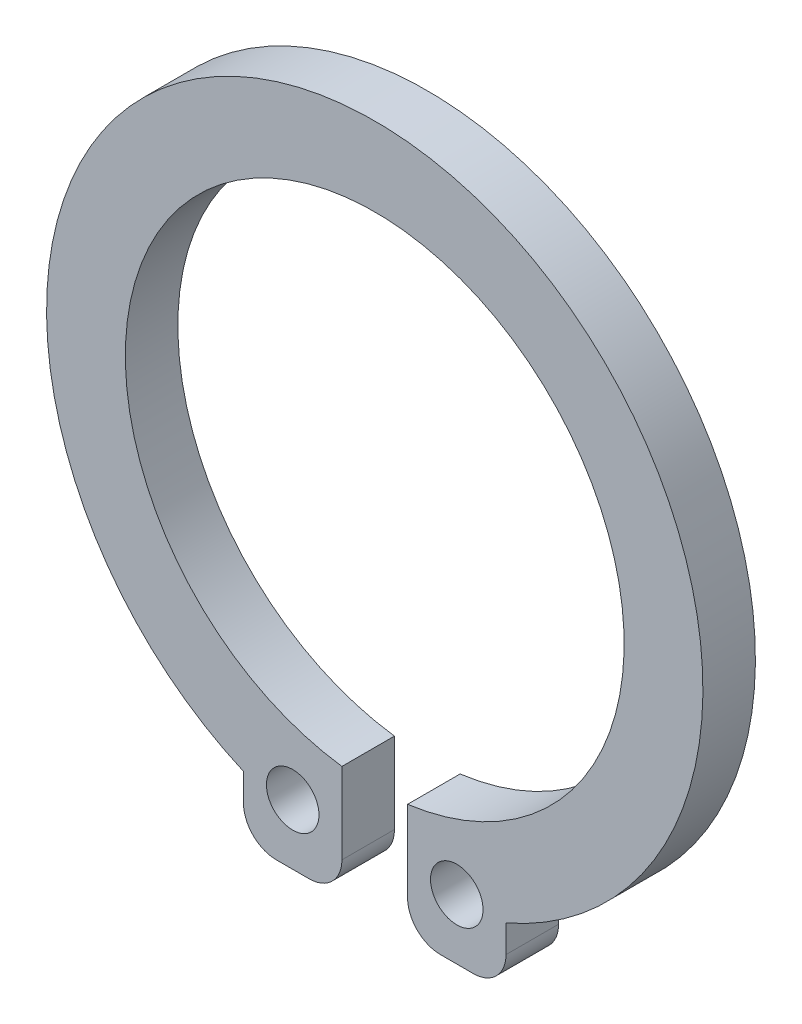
ISO-10303-21;
HEADER;
FILE_DESCRIPTION(('STEP AP214'),'2;1');
FILE_NAME('part.step','',(''),(''),'','','');
FILE_SCHEMA(('AUTOMOTIVE_DESIGN { 1 0 10303 214 1 1 1 1 }'));
ENDSEC;
DATA;
#1=APPLICATION_CONTEXT('core data for automotive mechanical design processes');
#2=APPLICATION_PROTOCOL_DEFINITION('international standard','automotive_design',2000,#1);
#3=PRODUCT_CONTEXT('',#1,'mechanical');
#4=PRODUCT('Part','Part','',(#3));
#5=PRODUCT_RELATED_PRODUCT_CATEGORY('part','',(#4));
#6=PRODUCT_DEFINITION_FORMATION('','',#4);
#7=PRODUCT_DEFINITION_CONTEXT('part definition',#1,'design');
#8=PRODUCT_DEFINITION('design','',#6,#7);
#9=PRODUCT_DEFINITION_SHAPE('','',#8);
#10=(LENGTH_UNIT() NAMED_UNIT(*) SI_UNIT(.MILLI.,.METRE.));
#11=(NAMED_UNIT(*) PLANE_ANGLE_UNIT() SI_UNIT($,.RADIAN.));
#12=(NAMED_UNIT(*) SI_UNIT($,.STERADIAN.) SOLID_ANGLE_UNIT());
#13=UNCERTAINTY_MEASURE_WITH_UNIT(LENGTH_MEASURE(1.E-05),#10,'distance_accuracy_value','');
#14=(GEOMETRIC_REPRESENTATION_CONTEXT(3) GLOBAL_UNCERTAINTY_ASSIGNED_CONTEXT((#13)) GLOBAL_UNIT_ASSIGNED_CONTEXT((#10,
#11,#12)) REPRESENTATION_CONTEXT('',''));
#15=CARTESIAN_POINT('',(0.,0.,0.));
#16=DIRECTION('',(0.,0.,1.));
#17=DIRECTION('',(1.,0.,0.));
#18=AXIS2_PLACEMENT_3D('',#15,#16,#17);
#19=CARTESIAN_POINT('',(0.,0.,0.799999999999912));
#20=DIRECTION('',(0.,0.,1.));
#21=DIRECTION('',(1.,0.,0.));
#22=AXIS2_PLACEMENT_3D('',#19,#20,#21);
#23=PLANE('',#22);
#24=CARTESIAN_POINT('',(-1.25000000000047,-4.58257569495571,0.800000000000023));
#25=DIRECTION('',(0.,0.,1.));
#26=DIRECTION('',(1.,0.,0.));
#27=AXIS2_PLACEMENT_3D('',#24,#25,#26);
#28=CIRCLE('',#27,0.4);
#29=CARTESIAN_POINT('',(-0.850000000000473,-4.58257569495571,0.800000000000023));
#30=VERTEX_POINT('',#29);
#31=EDGE_CURVE('E146',#30,#30,#28,.T.);
#32=ORIENTED_EDGE('',*,*,#31,.F.);
#33=EDGE_LOOP('',(#32));
#34=FACE_BOUND('',#33,.T.);
#35=CARTESIAN_POINT('',(0.,0.,0.799999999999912));
#36=DIRECTION('',(0.,0.,-1.));
#37=DIRECTION('',(1.,0.,0.));
#38=AXIS2_PLACEMENT_3D('',#35,#36,#37);
#39=CIRCLE('',#38,3.79999999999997);
#40=CARTESIAN_POINT('',(-0.500000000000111,-3.76696164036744,0.800000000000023));
#41=VERTEX_POINT('',#40);
#42=CARTESIAN_POINT('',(0.499999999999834,-3.76696164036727,0.799999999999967));
#43=VERTEX_POINT('',#42);
#44=EDGE_CURVE('E172',#41,#43,#39,.T.);
#45=ORIENTED_EDGE('',*,*,#44,.T.);
#46=DIRECTION('',(0.,-1.,0.));
#47=VECTOR('',#46,1.);
#48=CARTESIAN_POINT('',(0.499999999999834,-3.76696164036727,0.799999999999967));
#49=LINE('',#48,#47);
#50=CARTESIAN_POINT('',(0.5,-5.00000000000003,0.800000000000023));
#51=VERTEX_POINT('',#50);
#52=EDGE_CURVE('E141',#43,#51,#49,.T.);
#53=ORIENTED_EDGE('',*,*,#52,.T.);
#54=CARTESIAN_POINT('',(0.99999999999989,-5.,0.799999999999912));
#55=DIRECTION('',(0.,0.,1.));
#56=DIRECTION('',(-1.,0.,0.));
#57=AXIS2_PLACEMENT_3D('',#54,#55,#56);
#58=CIRCLE('',#57,0.5);
#59=CARTESIAN_POINT('',(1.,-5.50000000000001,0.800000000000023));
#60=VERTEX_POINT('',#59);
#61=EDGE_CURVE('E175',#51,#60,#58,.T.);
#62=ORIENTED_EDGE('',*,*,#61,.T.);
#63=DIRECTION('',(1.,3.69926311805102E-13,0.));
#64=VECTOR('',#63,1.);
#65=CARTESIAN_POINT('',(1.,-5.50000000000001,0.800000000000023));
#66=LINE('',#65,#64);
#67=CARTESIAN_POINT('',(1.49999999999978,-5.49999999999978,0.799999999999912));
#68=VERTEX_POINT('',#67);
#69=EDGE_CURVE('E177',#60,#68,#66,.T.);
#70=ORIENTED_EDGE('',*,*,#69,.T.);
#71=CARTESIAN_POINT('',(1.5,-4.9999999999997,0.799999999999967));
#72=DIRECTION('',(0.,0.,1.));
#73=DIRECTION('',(-1.,0.,0.));
#74=AXIS2_PLACEMENT_3D('',#71,#72,#73);
#75=CIRCLE('',#74,0.5);
#76=CARTESIAN_POINT('',(1.99999999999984,-4.99999999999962,0.799999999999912));
#77=VERTEX_POINT('',#76);
#78=EDGE_CURVE('E179',#68,#77,#75,.T.);
#79=ORIENTED_EDGE('',*,*,#78,.T.);
#80=DIRECTION('',(0.,1.,0.));
#81=VECTOR('',#80,1.);
#82=CARTESIAN_POINT('',(1.99999999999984,-4.99999999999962,0.799999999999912));
#83=LINE('',#82,#81);
#84=CARTESIAN_POINT('',(1.99999999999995,-4.58257569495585,0.800000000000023));
#85=VERTEX_POINT('',#84);
#86=EDGE_CURVE('E181',#77,#85,#83,.T.);
#87=ORIENTED_EDGE('',*,*,#86,.T.);
#88=CARTESIAN_POINT('',(0.,0.,0.799999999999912));
#89=DIRECTION('',(0.,0.,1.));
#90=DIRECTION('',(1.,0.,0.));
#91=AXIS2_PLACEMENT_3D('',#88,#89,#90);
#92=CIRCLE('',#91,5.);
#93=CARTESIAN_POINT('',(-2.,-4.58257569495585,0.799999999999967));
#94=VERTEX_POINT('',#93);
#95=EDGE_CURVE('E183',#85,#94,#92,.T.);
#96=ORIENTED_EDGE('',*,*,#95,.T.);
#97=DIRECTION('',(0.,-1.,0.));
#98=VECTOR('',#97,1.);
#99=CARTESIAN_POINT('',(-2.00000000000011,-4.99999999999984,0.799999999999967));
#100=LINE('',#99,#98);
#101=CARTESIAN_POINT('',(-2.00000000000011,-4.99999999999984,0.799999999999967));
#102=VERTEX_POINT('',#101);
#103=EDGE_CURVE('E185',#94,#102,#100,.T.);
#104=ORIENTED_EDGE('',*,*,#103,.T.);
#105=CARTESIAN_POINT('',(-1.50000000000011,-4.99999999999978,0.799999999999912));
#106=DIRECTION('',(0.,0.,1.));
#107=DIRECTION('',(1.,0.,0.));
#108=AXIS2_PLACEMENT_3D('',#105,#106,#107);
#109=CIRCLE('',#108,0.5);
#110=CARTESIAN_POINT('',(-1.50000000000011,-5.49999999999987,0.799999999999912));
#111=VERTEX_POINT('',#110);
#112=EDGE_CURVE('E187',#102,#111,#109,.T.);
#113=ORIENTED_EDGE('',*,*,#112,.T.);
#114=DIRECTION('',(1.,-3.65568686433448E-13,0.));
#115=VECTOR('',#114,1.);
#116=CARTESIAN_POINT('',(-1.00000000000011,-5.50000000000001,0.799999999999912));
#117=LINE('',#116,#115);
#118=CARTESIAN_POINT('',(-1.00000000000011,-5.50000000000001,0.799999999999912));
#119=VERTEX_POINT('',#118);
#120=EDGE_CURVE('E189',#111,#119,#117,.T.);
#121=ORIENTED_EDGE('',*,*,#120,.T.);
#122=CARTESIAN_POINT('',(-1.00000000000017,-4.99999999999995,0.799999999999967));
#123=DIRECTION('',(0.,0.,1.));
#124=DIRECTION('',(1.,0.,0.));
#125=AXIS2_PLACEMENT_3D('',#122,#123,#124);
#126=CIRCLE('',#125,0.5);
#127=CARTESIAN_POINT('',(-0.500000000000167,-4.99999999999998,0.799999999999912));
#128=VERTEX_POINT('',#127);
#129=EDGE_CURVE('E58',#119,#128,#126,.T.);
#130=ORIENTED_EDGE('',*,*,#129,.T.);
#131=DIRECTION('',(0.,1.,0.));
#132=VECTOR('',#131,1.);
#133=CARTESIAN_POINT('',(-0.500000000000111,-3.76696164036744,0.800000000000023));
#134=LINE('',#133,#132);
#135=EDGE_CURVE('E53',#128,#41,#134,.T.);
#136=ORIENTED_EDGE('',*,*,#135,.T.);
#137=EDGE_LOOP('',(#45,#53,#62,#70,#79,#87,#96,#104,#113,#121,#130,#136));
#138=FACE_BOUND('',#137,.T.);
#139=CARTESIAN_POINT('',(1.2500000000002,-4.58257569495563,0.799999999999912));
#140=DIRECTION('',(0.,0.,1.));
#141=DIRECTION('',(-1.,0.,0.));
#142=AXIS2_PLACEMENT_3D('',#139,#140,#141);
#143=CIRCLE('',#142,0.4);
#144=CARTESIAN_POINT('',(0.850000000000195,-4.58257569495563,0.799999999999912));
#145=VERTEX_POINT('',#144);
#146=EDGE_CURVE('E292',#145,#145,#143,.T.);
#147=ORIENTED_EDGE('',*,*,#146,.F.);
#148=EDGE_LOOP('',(#147));
#149=FACE_BOUND('',#148,.T.);
#150=ADVANCED_FACE('F38',(#34,#138,#149),#23,.T.);
#151=CARTESIAN_POINT('',(0.,0.,0.));
#152=DIRECTION('',(0.,0.,1.));
#153=DIRECTION('',(1.,0.,0.));
#154=AXIS2_PLACEMENT_3D('',#151,#152,#153);
#155=PLANE('',#154);
#156=CARTESIAN_POINT('',(-1.25000000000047,-4.58257569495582,0.));
#157=DIRECTION('',(0.,0.,1.));
#158=DIRECTION('',(1.,0.,0.));
#159=AXIS2_PLACEMENT_3D('',#156,#157,#158);
#160=CIRCLE('',#159,0.4);
#161=CARTESIAN_POINT('',(-0.850000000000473,-4.58257569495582,0.));
#162=VERTEX_POINT('',#161);
#163=EDGE_CURVE('E149',#162,#162,#160,.T.);
#164=ORIENTED_EDGE('',*,*,#163,.T.);
#165=EDGE_LOOP('',(#164));
#166=FACE_BOUND('',#165,.T.);
#167=CARTESIAN_POINT('',(0.,0.,0.));
#168=DIRECTION('',(0.,0.,-1.));
#169=DIRECTION('',(1.,0.,0.));
#170=AXIS2_PLACEMENT_3D('',#167,#168,#169);
#171=CIRCLE('',#170,3.79999999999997);
#172=CARTESIAN_POINT('',(-0.500000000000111,-3.76696164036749,0.));
#173=VERTEX_POINT('',#172);
#174=CARTESIAN_POINT('',(0.499999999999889,-3.76696164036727,0.));
#175=VERTEX_POINT('',#174);
#176=EDGE_CURVE('E132',#173,#175,#171,.T.);
#177=ORIENTED_EDGE('',*,*,#176,.F.);
#178=DIRECTION('',(0.,1.,0.));
#179=VECTOR('',#178,1.);
#180=CARTESIAN_POINT('',(-0.500000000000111,-3.76696164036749,0.));
#181=LINE('',#180,#179);
#182=CARTESIAN_POINT('',(-0.500000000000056,-5.,0.));
#183=VERTEX_POINT('',#182);
#184=EDGE_CURVE('E170',#183,#173,#181,.T.);
#185=ORIENTED_EDGE('',*,*,#184,.F.);
#186=CARTESIAN_POINT('',(-1.00000000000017,-4.99999999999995,0.));
#187=DIRECTION('',(0.,0.,1.));
#188=DIRECTION('',(1.,0.,0.));
#189=AXIS2_PLACEMENT_3D('',#186,#187,#188);
#190=CIRCLE('',#189,0.5);
#191=CARTESIAN_POINT('',(-1.00000000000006,-5.50000000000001,0.));
#192=VERTEX_POINT('',#191);
#193=EDGE_CURVE('E168',#192,#183,#190,.T.);
#194=ORIENTED_EDGE('',*,*,#193,.F.);
#195=DIRECTION('',(1.,-3.65568686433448E-13,0.));
#196=VECTOR('',#195,1.);
#197=CARTESIAN_POINT('',(-1.00000000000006,-5.50000000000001,0.));
#198=LINE('',#197,#196);
#199=CARTESIAN_POINT('',(-1.50000000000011,-5.49999999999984,0.));
#200=VERTEX_POINT('',#199);
#201=EDGE_CURVE('E166',#200,#192,#198,.T.);
#202=ORIENTED_EDGE('',*,*,#201,.F.);
#203=CARTESIAN_POINT('',(-1.5,-4.99999999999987,0.));
#204=DIRECTION('',(0.,0.,1.));
#205=DIRECTION('',(1.,0.,0.));
#206=AXIS2_PLACEMENT_3D('',#203,#204,#205);
#207=CIRCLE('',#206,0.5);
#208=CARTESIAN_POINT('',(-2.,-4.99999999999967,0.));
#209=VERTEX_POINT('',#208);
#210=EDGE_CURVE('E164',#209,#200,#207,.T.);
#211=ORIENTED_EDGE('',*,*,#210,.F.);
#212=DIRECTION('',(0.,-1.,0.));
#213=VECTOR('',#212,1.);
#214=CARTESIAN_POINT('',(-2.,-4.99999999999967,0.));
#215=LINE('',#214,#213);
#216=CARTESIAN_POINT('',(-2.00000000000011,-4.58257569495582,0.));
#217=VERTEX_POINT('',#216);
#218=EDGE_CURVE('E162',#217,#209,#215,.T.);
#219=ORIENTED_EDGE('',*,*,#218,.F.);
#220=CARTESIAN_POINT('',(0.,0.,0.));
#221=DIRECTION('',(0.,0.,1.));
#222=DIRECTION('',(1.,0.,0.));
#223=AXIS2_PLACEMENT_3D('',#220,#221,#222);
#224=CIRCLE('',#223,5.);
#225=CARTESIAN_POINT('',(2.,-4.58257569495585,0.));
#226=VERTEX_POINT('',#225);
#227=EDGE_CURVE('E160',#226,#217,#224,.T.);
#228=ORIENTED_EDGE('',*,*,#227,.F.);
#229=DIRECTION('',(0.,1.,0.));
#230=VECTOR('',#229,1.);
#231=CARTESIAN_POINT('',(1.99999999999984,-4.99999999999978,0.));
#232=LINE('',#231,#230);
#233=CARTESIAN_POINT('',(1.99999999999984,-4.99999999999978,0.));
#234=VERTEX_POINT('',#233);
#235=EDGE_CURVE('E158',#234,#226,#232,.T.);
#236=ORIENTED_EDGE('',*,*,#235,.F.);
#237=CARTESIAN_POINT('',(1.49999999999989,-4.99999999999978,-1.11022302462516E-13));
#238=DIRECTION('',(0.,0.,1.));
#239=DIRECTION('',(-1.,0.,0.));
#240=AXIS2_PLACEMENT_3D('',#237,#238,#239);
#241=CIRCLE('',#240,0.5);
#242=CARTESIAN_POINT('',(1.49999999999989,-5.49999999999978,0.));
#243=VERTEX_POINT('',#242);
#244=EDGE_CURVE('E156',#243,#234,#241,.T.);
#245=ORIENTED_EDGE('',*,*,#244,.F.);
#246=DIRECTION('',(1.,3.69926311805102E-13,0.));
#247=VECTOR('',#246,1.);
#248=CARTESIAN_POINT('',(1.,-5.49999999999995,0.));
#249=LINE('',#248,#247);
#250=CARTESIAN_POINT('',(1.,-5.49999999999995,0.));
#251=VERTEX_POINT('',#250);
#252=EDGE_CURVE('E154',#251,#243,#249,.T.);
#253=ORIENTED_EDGE('',*,*,#252,.F.);
#254=CARTESIAN_POINT('',(0.999999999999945,-4.99999999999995,0.));
#255=DIRECTION('',(0.,0.,1.));
#256=DIRECTION('',(-1.,0.,0.));
#257=AXIS2_PLACEMENT_3D('',#254,#255,#256);
#258=CIRCLE('',#257,0.5);
#259=CARTESIAN_POINT('',(0.499999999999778,-4.99999999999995,0.));
#260=VERTEX_POINT('',#259);
#261=EDGE_CURVE('E134',#260,#251,#258,.T.);
#262=ORIENTED_EDGE('',*,*,#261,.F.);
#263=DIRECTION('',(0.,-1.,0.));
#264=VECTOR('',#263,1.);
#265=CARTESIAN_POINT('',(0.499999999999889,-3.76696164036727,0.));
#266=LINE('',#265,#264);
#267=EDGE_CURVE('E127',#175,#260,#266,.T.);
#268=ORIENTED_EDGE('',*,*,#267,.F.);
#269=EDGE_LOOP('',(#177,#185,#194,#202,#211,#219,#228,#236,#245,#253,#262,#268));
#270=FACE_BOUND('',#269,.T.);
#271=CARTESIAN_POINT('',(1.25000000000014,-4.58257569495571,0.));
#272=DIRECTION('',(0.,0.,1.));
#273=DIRECTION('',(-1.,0.,0.));
#274=AXIS2_PLACEMENT_3D('',#271,#272,#273);
#275=CIRCLE('',#274,0.4);
#276=CARTESIAN_POINT('',(0.85000000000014,-4.58257569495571,0.));
#277=VERTEX_POINT('',#276);
#278=EDGE_CURVE('E295',#277,#277,#275,.T.);
#279=ORIENTED_EDGE('',*,*,#278,.T.);
#280=EDGE_LOOP('',(#279));
#281=FACE_BOUND('',#280,.T.);
#282=ADVANCED_FACE('F128',(#166,#270,#281),#155,.F.);
#283=CARTESIAN_POINT('',(0.,0.,0.799999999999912));
#284=DIRECTION('',(0.,0.,-1.));
#285=DIRECTION('',(-1.,0.,0.));
#286=AXIS2_PLACEMENT_3D('',#283,#284,#285);
#287=CYLINDRICAL_SURFACE('',#286,3.79999999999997);
#288=ORIENTED_EDGE('',*,*,#176,.T.);
#289=DIRECTION('',(0.,0.,-1.));
#290=VECTOR('',#289,1.);
#291=CARTESIAN_POINT('',(0.499999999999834,-3.76696164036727,0.799999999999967));
#292=LINE('',#291,#290);
#293=EDGE_CURVE('E11',#43,#175,#292,.T.);
#294=ORIENTED_EDGE('',*,*,#293,.F.);
#295=ORIENTED_EDGE('',*,*,#44,.F.);
#296=DIRECTION('',(0.,0.,-1.));
#297=VECTOR('',#296,1.);
#298=CARTESIAN_POINT('',(-0.500000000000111,-3.76696164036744,0.800000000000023));
#299=LINE('',#298,#297);
#300=EDGE_CURVE('E145',#41,#173,#299,.T.);
#301=ORIENTED_EDGE('',*,*,#300,.T.);
#302=EDGE_LOOP('',(#288,#294,#295,#301));
#303=FACE_BOUND('',#302,.T.);
#304=ADVANCED_FACE('F40',(#303),#287,.F.);
#305=CARTESIAN_POINT('',(0.499999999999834,-3.76696164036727,0.799999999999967));
#306=DIRECTION('',(1.,0.,0.));
#307=DIRECTION('',(0.,1.,0.));
#308=AXIS2_PLACEMENT_3D('',#305,#306,#307);
#309=PLANE('',#308);
#310=ORIENTED_EDGE('',*,*,#267,.T.);
#311=DIRECTION('',(0.,0.,-1.));
#312=VECTOR('',#311,1.);
#313=CARTESIAN_POINT('',(0.5,-5.00000000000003,0.800000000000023));
#314=LINE('',#313,#312);
#315=EDGE_CURVE('E46',#51,#260,#314,.T.);
#316=ORIENTED_EDGE('',*,*,#315,.F.);
#317=ORIENTED_EDGE('',*,*,#52,.F.);
#318=ORIENTED_EDGE('',*,*,#293,.T.);
#319=EDGE_LOOP('',(#310,#316,#317,#318));
#320=FACE_BOUND('',#319,.T.);
#321=ADVANCED_FACE('F140',(#320),#309,.F.);
#322=CARTESIAN_POINT('',(0.99999999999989,-5.,0.799999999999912));
#323=DIRECTION('',(0.,0.,-1.));
#324=DIRECTION('',(-1.,0.,0.));
#325=AXIS2_PLACEMENT_3D('',#322,#323,#324);
#326=CYLINDRICAL_SURFACE('',#325,0.5);
#327=ORIENTED_EDGE('',*,*,#261,.T.);
#328=DIRECTION('',(0.,0.,-1.));
#329=VECTOR('',#328,1.);
#330=CARTESIAN_POINT('',(1.,-5.50000000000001,0.800000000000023));
#331=LINE('',#330,#329);
#332=EDGE_CURVE('E218',#60,#251,#331,.T.);
#333=ORIENTED_EDGE('',*,*,#332,.F.);
#334=ORIENTED_EDGE('',*,*,#61,.F.);
#335=ORIENTED_EDGE('',*,*,#315,.T.);
#336=EDGE_LOOP('',(#327,#333,#334,#335));
#337=FACE_BOUND('',#336,.T.);
#338=ADVANCED_FACE('F222',(#337),#326,.T.);
#339=CARTESIAN_POINT('',(1.,-5.50000000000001,0.800000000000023));
#340=DIRECTION('',(-3.69038133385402E-13,1.,0.));
#341=DIRECTION('',(-1.,-3.69926311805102E-13,0.));
#342=AXIS2_PLACEMENT_3D('',#339,#340,#341);
#343=PLANE('',#342);
#344=ORIENTED_EDGE('',*,*,#252,.T.);
#345=DIRECTION('',(0.,0.,-1.));
#346=VECTOR('',#345,1.);
#347=CARTESIAN_POINT('',(1.49999999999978,-5.49999999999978,0.799999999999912));
#348=LINE('',#347,#346);
#349=EDGE_CURVE('E215',#68,#243,#348,.T.);
#350=ORIENTED_EDGE('',*,*,#349,.F.);
#351=ORIENTED_EDGE('',*,*,#69,.F.);
#352=ORIENTED_EDGE('',*,*,#332,.T.);
#353=EDGE_LOOP('',(#344,#350,#351,#352));
#354=FACE_BOUND('',#353,.T.);
#355=ADVANCED_FACE('F230',(#354),#343,.F.);
#356=CARTESIAN_POINT('',(1.5,-4.9999999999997,0.799999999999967));
#357=DIRECTION('',(0.,0.,-1.));
#358=DIRECTION('',(-1.,0.,0.));
#359=AXIS2_PLACEMENT_3D('',#356,#357,#358);
#360=CYLINDRICAL_SURFACE('',#359,0.5);
#361=ORIENTED_EDGE('',*,*,#244,.T.);
#362=DIRECTION('',(0.,0.,-1.));
#363=VECTOR('',#362,1.);
#364=CARTESIAN_POINT('',(1.99999999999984,-4.99999999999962,0.799999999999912));
#365=LINE('',#364,#363);
#366=EDGE_CURVE('E212',#77,#234,#365,.T.);
#367=ORIENTED_EDGE('',*,*,#366,.F.);
#368=ORIENTED_EDGE('',*,*,#78,.F.);
#369=ORIENTED_EDGE('',*,*,#349,.T.);
#370=EDGE_LOOP('',(#361,#367,#368,#369));
#371=FACE_BOUND('',#370,.T.);
#372=ADVANCED_FACE('F233',(#371),#360,.T.);
#373=CARTESIAN_POINT('',(1.99999999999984,-4.99999999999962,0.799999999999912));
#374=DIRECTION('',(-1.,0.,0.));
#375=DIRECTION('',(0.,-1.,0.));
#376=AXIS2_PLACEMENT_3D('',#373,#374,#375);
#377=PLANE('',#376);
#378=ORIENTED_EDGE('',*,*,#235,.T.);
#379=DIRECTION('',(0.,0.,-1.));
#380=VECTOR('',#379,1.);
#381=CARTESIAN_POINT('',(1.99999999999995,-4.58257569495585,0.800000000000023));
#382=LINE('',#381,#380);
#383=EDGE_CURVE('E209',#85,#226,#382,.T.);
#384=ORIENTED_EDGE('',*,*,#383,.F.);
#385=ORIENTED_EDGE('',*,*,#86,.F.);
#386=ORIENTED_EDGE('',*,*,#366,.T.);
#387=EDGE_LOOP('',(#378,#384,#385,#386));
#388=FACE_BOUND('',#387,.T.);
#389=ADVANCED_FACE('F238',(#388),#377,.F.);
#390=CARTESIAN_POINT('',(0.,0.,0.799999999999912));
#391=DIRECTION('',(0.,0.,-1.));
#392=DIRECTION('',(-1.,0.,0.));
#393=AXIS2_PLACEMENT_3D('',#390,#391,#392);
#394=CYLINDRICAL_SURFACE('',#393,5.);
#395=ORIENTED_EDGE('',*,*,#227,.T.);
#396=DIRECTION('',(0.,0.,-1.));
#397=VECTOR('',#396,1.);
#398=CARTESIAN_POINT('',(-2.,-4.58257569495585,0.799999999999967));
#399=LINE('',#398,#397);
#400=EDGE_CURVE('E206',#94,#217,#399,.T.);
#401=ORIENTED_EDGE('',*,*,#400,.F.);
#402=ORIENTED_EDGE('',*,*,#95,.F.);
#403=ORIENTED_EDGE('',*,*,#383,.T.);
#404=EDGE_LOOP('',(#395,#401,#402,#403));
#405=FACE_BOUND('',#404,.T.);
#406=ADVANCED_FACE('F244',(#405),#394,.T.);
#407=CARTESIAN_POINT('',(-2.00000000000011,-4.99999999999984,0.799999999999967));
#408=DIRECTION('',(1.,0.,0.));
#409=DIRECTION('',(0.,1.,0.));
#410=AXIS2_PLACEMENT_3D('',#407,#408,#409);
#411=PLANE('',#410);
#412=ORIENTED_EDGE('',*,*,#218,.T.);
#413=DIRECTION('',(0.,0.,-1.));
#414=VECTOR('',#413,1.);
#415=CARTESIAN_POINT('',(-2.00000000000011,-4.99999999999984,0.799999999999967));
#416=LINE('',#415,#414);
#417=EDGE_CURVE('E203',#102,#209,#416,.T.);
#418=ORIENTED_EDGE('',*,*,#417,.F.);
#419=ORIENTED_EDGE('',*,*,#103,.F.);
#420=ORIENTED_EDGE('',*,*,#400,.T.);
#421=EDGE_LOOP('',(#412,#418,#419,#420));
#422=FACE_BOUND('',#421,.T.);
#423=ADVANCED_FACE('F248',(#422),#411,.F.);
#424=CARTESIAN_POINT('',(-1.50000000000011,-4.99999999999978,0.799999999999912));
#425=DIRECTION('',(0.,0.,-1.));
#426=DIRECTION('',(-1.,0.,0.));
#427=AXIS2_PLACEMENT_3D('',#424,#425,#426);
#428=CYLINDRICAL_SURFACE('',#427,0.5);
#429=ORIENTED_EDGE('',*,*,#210,.T.);
#430=DIRECTION('',(0.,0.,-1.));
#431=VECTOR('',#430,1.);
#432=CARTESIAN_POINT('',(-1.50000000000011,-5.49999999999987,0.799999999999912));
#433=LINE('',#432,#431);
#434=EDGE_CURVE('E200',#111,#200,#433,.T.);
#435=ORIENTED_EDGE('',*,*,#434,.F.);
#436=ORIENTED_EDGE('',*,*,#112,.F.);
#437=ORIENTED_EDGE('',*,*,#417,.T.);
#438=EDGE_LOOP('',(#429,#435,#436,#437));
#439=FACE_BOUND('',#438,.T.);
#440=ADVANCED_FACE('F253',(#439),#428,.T.);
#441=CARTESIAN_POINT('',(-1.00000000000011,-5.50000000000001,0.799999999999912));
#442=DIRECTION('',(3.66456864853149E-13,1.,0.));
#443=DIRECTION('',(-1.,3.65568686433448E-13,0.));
#444=AXIS2_PLACEMENT_3D('',#441,#442,#443);
#445=PLANE('',#444);
#446=ORIENTED_EDGE('',*,*,#201,.T.);
#447=DIRECTION('',(0.,0.,-1.));
#448=VECTOR('',#447,1.);
#449=CARTESIAN_POINT('',(-1.00000000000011,-5.50000000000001,0.799999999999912));
#450=LINE('',#449,#448);
#451=EDGE_CURVE('E197',#119,#192,#450,.T.);
#452=ORIENTED_EDGE('',*,*,#451,.F.);
#453=ORIENTED_EDGE('',*,*,#120,.F.);
#454=ORIENTED_EDGE('',*,*,#434,.T.);
#455=EDGE_LOOP('',(#446,#452,#453,#454));
#456=FACE_BOUND('',#455,.T.);
#457=ADVANCED_FACE('F257',(#456),#445,.F.);
#458=CARTESIAN_POINT('',(-1.00000000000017,-4.99999999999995,0.799999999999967));
#459=DIRECTION('',(0.,0.,-1.));
#460=DIRECTION('',(-1.,0.,0.));
#461=AXIS2_PLACEMENT_3D('',#458,#459,#460);
#462=CYLINDRICAL_SURFACE('',#461,0.5);
#463=ORIENTED_EDGE('',*,*,#193,.T.);
#464=DIRECTION('',(0.,0.,-1.));
#465=VECTOR('',#464,1.);
#466=CARTESIAN_POINT('',(-0.500000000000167,-4.99999999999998,0.799999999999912));
#467=LINE('',#466,#465);
#468=EDGE_CURVE('E194',#128,#183,#467,.T.);
#469=ORIENTED_EDGE('',*,*,#468,.F.);
#470=ORIENTED_EDGE('',*,*,#129,.F.);
#471=ORIENTED_EDGE('',*,*,#451,.T.);
#472=EDGE_LOOP('',(#463,#469,#470,#471));
#473=FACE_BOUND('',#472,.T.);
#474=ADVANCED_FACE('F261',(#473),#462,.T.);
#475=CARTESIAN_POINT('',(-0.500000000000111,-3.76696164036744,0.800000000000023));
#476=DIRECTION('',(-1.,0.,0.));
#477=DIRECTION('',(0.,-1.,0.));
#478=AXIS2_PLACEMENT_3D('',#475,#476,#477);
#479=PLANE('',#478);
#480=ORIENTED_EDGE('',*,*,#184,.T.);
#481=ORIENTED_EDGE('',*,*,#300,.F.);
#482=ORIENTED_EDGE('',*,*,#135,.F.);
#483=ORIENTED_EDGE('',*,*,#468,.T.);
#484=EDGE_LOOP('',(#480,#481,#482,#483));
#485=FACE_BOUND('',#484,.T.);
#486=ADVANCED_FACE('F263',(#485),#479,.F.);
#487=CARTESIAN_POINT('',(-1.25000000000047,-4.58257569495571,0.800000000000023));
#488=DIRECTION('',(0.,0.,-1.));
#489=DIRECTION('',(-1.,0.,0.));
#490=AXIS2_PLACEMENT_3D('',#487,#488,#489);
#491=CYLINDRICAL_SURFACE('',#490,0.4);
#492=ORIENTED_EDGE('',*,*,#31,.T.);
#493=EDGE_LOOP('',(#492));
#494=FACE_BOUND('',#493,.T.);
#495=ORIENTED_EDGE('',*,*,#163,.F.);
#496=EDGE_LOOP('',(#495));
#497=FACE_BOUND('',#496,.T.);
#498=ADVANCED_FACE('F265',(#494,#497),#491,.F.);
#499=CARTESIAN_POINT('',(1.2500000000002,-4.58257569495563,0.799999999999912));
#500=DIRECTION('',(0.,0.,-1.));
#501=DIRECTION('',(-1.,0.,0.));
#502=AXIS2_PLACEMENT_3D('',#499,#500,#501);
#503=CYLINDRICAL_SURFACE('',#502,0.4);
#504=ORIENTED_EDGE('',*,*,#146,.T.);
#505=EDGE_LOOP('',(#504));
#506=FACE_BOUND('',#505,.T.);
#507=ORIENTED_EDGE('',*,*,#278,.F.);
#508=EDGE_LOOP('',(#507));
#509=FACE_BOUND('',#508,.T.);
#510=ADVANCED_FACE('F271',(#506,#509),#503,.F.);
#511=CLOSED_SHELL('',(#150,#282,#304,#321,#338,#355,#372,#389,#406,#423,#440,#457,#474,#486,
#498,#510));
#512=MANIFOLD_SOLID_BREP('B2',#511);
#513=ADVANCED_BREP_SHAPE_REPRESENTATION('',(#18,#512),#14);
#514=SHAPE_DEFINITION_REPRESENTATION(#9,#513);
ENDSEC;
END-ISO-10303-21;
